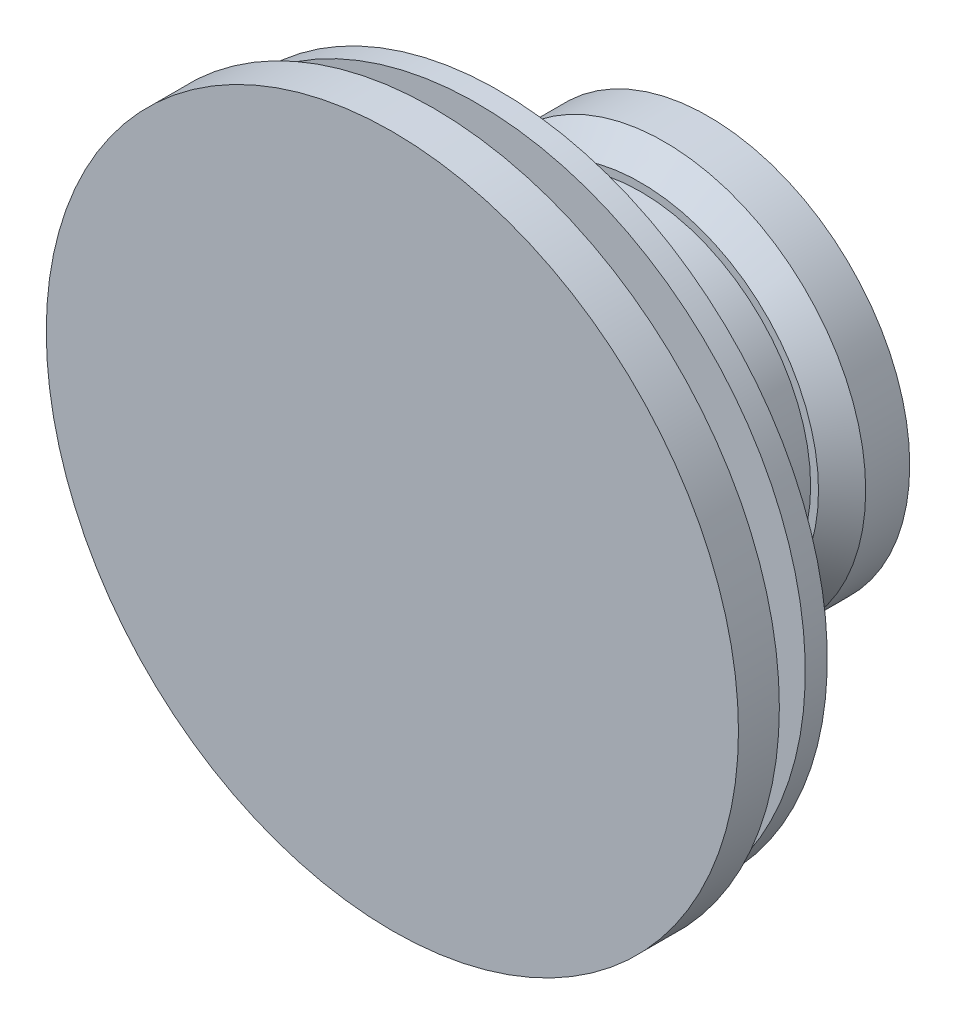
from build123d import *

# Parameters (mm, degrees)
CUT_EXTRUDE1_DEPTH = 0.254


with BuildPart() as part:
    # Sketch1 → Revolve1 (revolve)
    with BuildSketch(Plane(origin=(0, 0, 0), x_dir=(1, 0, 0), z_dir=(0, 1, 0)), mode=Mode.PRIVATE) as revolve1_sk:
        with BuildLine():
            Line((0, 0), (27.94, 0))
            Line((27.94, 0), (27.94, 3.302))
            Line((27.94, 3.302), (24.13, 3.302))
            Line((24.13, 3.302), (24.13, 4.302))
            Line((24.13, 4.302), (22.0472, 4.302))
            Line((22.0472, 4.302), (22.0472, 6.842))
            Line((22.0472, 6.842), (26.4922, 6.842))
            Line((26.4922, 6.842), (26.4922, 8.62))
            Line((26.4922, 8.62), (13.716, 8.62))
            Line((13.716, 8.62), (13.716, 20.05))
            Line((13.716, 20.05), (14.351, 20.05))
            Line((14.351, 20.05), (16.256, 21.955))
            Line((16.256, 21.955), (16.256, 25.511))
            Line((16.256, 25.511), (15.256000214, 25.511654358))
            Line((15.256000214, 25.511654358), (15.256000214, 25.003654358))
            Line((15.256000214, 25.003654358), (12.208000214, 23.243890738))
            ThreePointArc((12.208000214, 23.243890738), (6.136515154, 24.189362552), (0, 24.505637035))
            Line((0, 24.505637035), (0, 0))
        make_face()
    revolve(revolve1_sk.sketch.rotate(Axis((0, 0, 0), (0, 0, 1)), 180), axis=Axis((0, 0, 0), (0, 0, 1)))

    # Sketch2 → Cut-Extrude1 (cut)
    with BuildSketch(Plane(origin=(0, 0, -8.62), x_dir=(-1, 0, 0), z_dir=(0, 0, -1))):
        with BuildLine():
            Line((-6.435897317, -19.51201886), (-6.749999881, -19.51201886))
            add(Edge.make_bspline(
                [(-6.749999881, -19.51201886), (-6.747952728, -19.470347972), (-6.743932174, -19.388507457), (-6.725103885, -19.269183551), (-6.698163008, -19.155128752), (-6.660071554, -19.047258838), (-6.612765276, -18.944620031), (-6.556035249, -18.847620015), (-6.488841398, -18.756628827), (-6.412634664, -18.672489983), (-6.329866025, -18.595302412), (-6.240560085, -18.52864717), (-6.146715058, -18.472329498), (-6.048615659, -18.425248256), (-5.945155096, -18.389908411), (-5.837272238, -18.363686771), (-5.724493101, -18.347910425), (-5.647653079, -18.34621464), (-5.608573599, -18.345352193)],
                knots=[0, 0, 0, 0, 1.10065271, 2.161652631, 3.183658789, 4.190468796, 5.17591951, 6.163126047, 7.15150782, 8.156236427, 9.156009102, 10.134482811, 11.092018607, 12.041330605, 13.001268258, 13.972401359, 14.968799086, 16, 16, 16, 16], degree=3))
            add(Edge.make_bspline(
                [(-5.608573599, -18.345352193), (-5.570195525, -18.346250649), (-5.49478398, -18.348016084), (-5.384721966, -18.363177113), (-5.279944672, -18.386922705), (-5.180656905, -18.420238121), (-5.08765084, -18.465022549), (-5.000227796, -18.518820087), (-4.917346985, -18.581039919), (-4.842740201, -18.654293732), (-4.774232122, -18.732496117), (-4.715129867, -18.81598402), (-4.664516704, -18.902213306), (-4.622329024, -18.991841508), (-4.591272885, -19.085712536), (-4.567694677, -19.182459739), (-4.554367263, -19.28308455), (-4.55232184, -19.351191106), (-4.551281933, -19.385816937)],
                knots=[0, 0, 0, 0, 1.111607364, 2.184268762, 3.212621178, 4.221274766, 5.211760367, 6.196651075, 7.1921475, 8.207485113, 9.220403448, 10.201281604, 11.166441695, 12.114753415, 13.065576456, 14.026450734, 14.996634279, 16, 16, 16, 16], degree=3))
            add(Edge.make_bspline(
                [(-4.551281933, -19.385816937), (-4.552975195, -19.434564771), (-4.556332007, -19.531204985), (-4.585046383, -19.673219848), (-4.629892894, -19.810813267), (-4.683890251, -19.921550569), (-4.738362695, -20.010784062), (-4.787450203, -20.084252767), (-4.844915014, -20.163358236), (-4.911593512, -20.247835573), (-4.986106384, -20.338346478), (-5.069128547, -20.434836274), (-5.161252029, -20.536308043), (-5.22591053, -20.605613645), (-5.259414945, -20.641526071)],
                knots=[0, 0, 0, 0, 1.184426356, 2.348067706, 3.509069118, 4.696110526, 5.333549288, 6.050745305, 6.844228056, 7.710549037, 8.667450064, 9.695053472, 10.805634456, 12, 12, 12, 12], degree=3))
            Line((-5.259414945, -20.641526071), (-6.135116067, -21.576121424))
            Line((-6.135116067, -21.576121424), (-4.506410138, -21.576121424))
            Line((-4.506410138, -21.576121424), (-4.506410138, -21.935095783))
            Line((-4.506410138, -21.935095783), (-6.884615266, -21.935095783))
            Line((-6.884615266, -21.935095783), (-5.527243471, -20.486578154))
            add(Edge.make_bspline(
                [(-5.527243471, -20.486578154), (-5.494195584, -20.452079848), (-5.430717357, -20.385815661), (-5.34093478, -20.289072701), (-5.260295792, -20.19932316), (-5.188278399, -20.116736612), (-5.126444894, -20.040105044), (-5.071572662, -19.971910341), (-5.027607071, -19.90915589), (-4.979891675, -19.836415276), (-4.933677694, -19.747602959), (-4.893965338, -19.63906927), (-4.869750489, -19.527342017), (-4.866845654, -19.45183998), (-4.865384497, -19.413861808)],
                knots=[0, 0, 0, 0, 1.329631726, 2.553950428, 3.673215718, 4.687767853, 5.603093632, 6.413772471, 7.123043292, 7.734684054, 8.834405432, 9.900288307, 10.943827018, 12, 12, 12, 12], degree=3))
            add(Edge.make_bspline(
                [(-4.865384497, -19.413861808), (-4.866020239, -19.38998041), (-4.867273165, -19.34291476), (-4.878330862, -19.273909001), (-4.895041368, -19.207344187), (-4.918986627, -19.143015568), (-4.950593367, -19.081569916), (-4.989066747, -19.022932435), (-5.03345681, -18.96624347), (-5.084808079, -18.913090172), (-5.141219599, -18.864408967), (-5.200813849, -18.821284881), (-5.263863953, -18.78524577), (-5.330104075, -18.755702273), (-5.399349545, -18.732526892), (-5.47173429, -18.716468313), (-5.547058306, -18.706385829), (-5.598491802, -18.705021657), (-5.6246994, -18.704326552)],
                knots=[0, 0, 0, 0, 0.991446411, 1.95395049, 2.89581595, 3.838931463, 4.798493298, 5.75982156, 6.748411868, 7.785213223, 8.824556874, 9.840280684, 10.836137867, 11.835679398, 12.848801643, 13.863922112, 14.911575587, 16, 16, 16, 16], degree=3))
            add(Edge.make_bspline(
                [(-5.6246994, -18.704326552), (-5.652070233, -18.705041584), (-5.705822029, -18.706445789), (-5.784741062, -18.716268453), (-5.86002684, -18.733214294), (-5.931868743, -18.756390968), (-6.000388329, -18.785849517), (-6.065252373, -18.822541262), (-6.126315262, -18.866324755), (-6.183691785, -18.915965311), (-6.236555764, -18.971232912), (-6.28300264, -19.032842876), (-6.323586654, -19.099670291), (-6.358995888, -19.171534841), (-6.387751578, -19.249088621), (-6.409724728, -19.332056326), (-6.427111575, -19.420077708), (-6.432920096, -19.480862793), (-6.435897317, -19.51201886)],
                knots=[0, 0, 0, 0, 1.031018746, 2.02475058, 2.990194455, 3.934040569, 4.864654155, 5.795059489, 6.735614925, 7.690564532, 8.649604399, 9.611025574, 10.590972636, 11.591080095, 12.624614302, 13.701020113, 14.821632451, 16, 16, 16, 16], degree=3))
        make_face()
        with BuildLine():
            Line((-1.993589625, -18.435095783), (-1.993589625, -18.794070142))
            Line((-1.993589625, -18.794070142), (-3.184094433, -18.794070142))
            Line((-3.184094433, -18.794070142), (-3.372696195, -19.714643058))
            add(Edge.make_bspline(
                [(-3.372696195, -19.714643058), (-3.335640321, -19.704412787), (-3.263850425, -19.684593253), (-3.157890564, -19.662587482), (-3.057298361, -19.649322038), (-2.99202299, -19.647510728), (-2.96043658, -19.646634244)],
                knots=[0, 0, 0, 0, 1.100273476, 2.13160584, 3.095893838, 4, 4, 4, 4], degree=3))
            add(Edge.make_bspline(
                [(-2.96043658, -19.646634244), (-2.92135284, -19.64748018), (-2.844504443, -19.649143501), (-2.732065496, -19.66511535), (-2.624732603, -19.690255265), (-2.522730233, -19.725375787), (-2.425869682, -19.77028552), (-2.33504212, -19.82638546), (-2.248884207, -19.891918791), (-2.168941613, -19.967263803), (-2.096417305, -20.05018542), (-2.032651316, -20.139343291), (-1.978488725, -20.233870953), (-1.93492797, -20.334671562), (-1.900143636, -20.440630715), (-1.876991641, -20.552863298), (-1.861574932, -20.670311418), (-1.859852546, -20.750615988), (-1.85897424, -20.791566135)],
                knots=[0, 0, 0, 0, 1.052922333, 2.070308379, 3.05430497, 4.020497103, 4.973039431, 5.925935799, 6.892292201, 7.88610001, 8.88166317, 9.857072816, 10.836096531, 11.812156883, 12.81219415, 13.836441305, 14.89672472, 16, 16, 16, 16], degree=3))
            add(Edge.make_bspline(
                [(-1.85897424, -20.791566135), (-1.859639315, -20.820088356), (-1.860960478, -20.876747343), (-1.867679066, -20.960891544), (-1.880614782, -21.043254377), (-1.897982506, -21.123846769), (-1.920524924, -21.202516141), (-1.947813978, -21.279487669), (-1.981210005, -21.354282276), (-2.017841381, -21.427607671), (-2.059087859, -21.497806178), (-2.104866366, -21.563455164), (-2.153231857, -21.625539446), (-2.205273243, -21.683393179), (-2.261474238, -21.736636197), (-2.321154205, -21.785584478), (-2.383836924, -21.831065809), (-2.450492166, -21.871234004), (-2.519634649, -21.90819696), (-2.592262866, -21.938520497), (-2.666723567, -21.965631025), (-2.744088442, -21.987240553), (-2.824182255, -22.004173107), (-2.90713703, -22.015673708), (-2.9925177, -22.024050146), (-3.050392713, -22.024574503), (-3.079627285, -22.024839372)],
                knots=[0, 0, 0, 0, 1.056347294, 2.098418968, 3.122841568, 4.141288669, 5.149314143, 6.15115421, 7.162517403, 8.180376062, 9.185164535, 10.17417709, 11.141909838, 12.097768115, 13.052685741, 14.0056014, 14.954263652, 15.917497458, 16.885230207, 17.854509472, 18.828990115, 19.81800267, 20.826176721, 21.857883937, 22.917946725, 24, 24, 24, 24], degree=3))
            add(Edge.make_bspline(
                [(-3.079627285, -22.024839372), (-3.114501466, -22.024148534), (-3.183112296, -22.022789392), (-3.283632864, -22.008570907), (-3.380347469, -21.988206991), (-3.47247757, -21.957570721), (-3.560848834, -21.919183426), (-3.644271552, -21.870667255), (-3.724877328, -21.815688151), (-3.799389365, -21.750807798), (-3.868545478, -21.679892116), (-3.930451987, -21.602934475), (-3.985585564, -21.521205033), (-4.033063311, -21.434306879), (-4.073561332, -21.342468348), (-4.10537632, -21.245345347), (-4.131054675, -21.143445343), (-4.141918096, -21.073291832), (-4.147435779, -21.037659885)],
                knots=[0, 0, 0, 0, 1.0467383, 2.05933395, 3.04377827, 4.011590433, 4.970194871, 5.932262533, 6.905835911, 7.896367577, 8.894135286, 9.877477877, 10.858688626, 11.851381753, 12.8477658, 13.868841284, 14.917554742, 16, 16, 16, 16], degree=3))
            Line((-4.147435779, -21.037659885), (-3.833333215, -21.037659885))
            add(Edge.make_bspline(
                [(-3.833333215, -21.037659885), (-3.825604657, -21.071036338), (-3.810749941, -21.135187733), (-3.778144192, -21.225319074), (-3.738278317, -21.305638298), (-3.690873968, -21.377207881), (-3.634323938, -21.439616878), (-3.569794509, -21.49523394), (-3.497446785, -21.545409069), (-3.417053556, -21.587231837), (-3.332240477, -21.62290059), (-3.243473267, -21.646652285), (-3.15316892, -21.663353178), (-3.09209055, -21.665024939), (-3.061398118, -21.665865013)],
                knots=[0, 0, 0, 0, 1.136247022, 2.183929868, 3.172523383, 4.106158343, 5.02341133, 5.958108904, 6.928429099, 7.938127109, 8.96079061, 9.975095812, 10.982467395, 12, 12, 12, 12], degree=3))
            add(Edge.make_bspline(
                [(-3.061398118, -21.665865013), (-3.031439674, -21.665044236), (-2.972451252, -21.663428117), (-2.885639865, -21.650989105), (-2.801826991, -21.631831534), (-2.721839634, -21.603161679), (-2.644278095, -21.56831696), (-2.571104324, -21.523601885), (-2.500201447, -21.472141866), (-2.433773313, -21.413185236), (-2.372933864, -21.348215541), (-2.319177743, -21.278738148), (-2.27440083, -21.204621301), (-2.236666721, -21.127148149), (-2.208013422, -21.045469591), (-2.187572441, -20.959968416), (-2.175569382, -20.870433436), (-2.173918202, -20.809364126), (-2.173076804, -20.778244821)],
                knots=[0, 0, 0, 0, 1.027316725, 2.022795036, 3.002884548, 3.971462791, 4.93288096, 5.914575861, 6.907176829, 7.935150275, 8.956128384, 9.956726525, 10.942570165, 11.921478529, 12.907843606, 13.90538589, 14.932640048, 16, 16, 16, 16], degree=3))
            add(Edge.make_bspline(
                [(-2.173076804, -20.778244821), (-2.173735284, -20.75016907), (-2.175024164, -20.69521478), (-2.185554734, -20.614815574), (-2.203871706, -20.538742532), (-2.229295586, -20.466628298), (-2.261575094, -20.398404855), (-2.301021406, -20.334001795), (-2.348374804, -20.274267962), (-2.402466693, -20.219175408), (-2.461724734, -20.168330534), (-2.527168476, -20.124986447), (-2.597428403, -20.088522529), (-2.671658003, -20.057054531), (-2.751622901, -20.034453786), (-2.835739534, -20.0174859), (-2.924916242, -20.007670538), (-2.98588693, -20.006308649), (-3.017227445, -20.005608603)],
                knots=[0, 0, 0, 0, 1.045622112, 2.046656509, 3.013763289, 3.955457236, 4.890082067, 5.820317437, 6.762574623, 7.722996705, 8.69280354, 9.665887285, 10.63943826, 11.638615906, 12.663482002, 13.728887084, 14.832589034, 16, 16, 16, 16], degree=3))
            add(Edge.make_bspline(
                [(-3.017227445, -20.005608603), (-3.044356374, -20.006189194), (-3.100370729, -20.007387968), (-3.186293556, -20.016214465), (-3.276585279, -20.030453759), (-3.370899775, -20.050040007), (-3.469520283, -20.075671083), (-3.572238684, -20.106385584), (-3.67927095, -20.143107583), (-3.751388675, -20.170839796), (-3.78846142, -20.185095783)],
                knots=[0, 0, 0, 0, 0.817624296, 1.688186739, 2.600797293, 3.572016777, 4.590301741, 5.671205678, 6.80286297, 8, 8, 8, 8], degree=3))
            Line((-3.78846142, -20.185095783), (-3.429487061, -18.435095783))
            Line((-3.429487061, -18.435095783), (-1.993589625, -18.435095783))
        make_face()
        with BuildLine():
            Line((-1.275640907, -19.377403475), (-0.961538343, -19.377403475))
            Line((-0.961538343, -19.377403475), (-0.961538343, -19.821914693))
            add(Edge.make_bspline(
                [(-0.961538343, -19.821914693), (-0.933254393, -19.783027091), (-0.879059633, -19.708514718), (-0.790193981, -19.610324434), (-0.701417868, -19.526996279), (-0.637484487, -19.483253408), (-0.606770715, -19.462239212)],
                knots=[0, 0, 0, 0, 1.134379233, 2.173579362, 3.122582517, 4, 4, 4, 4], degree=3))
            add(Edge.make_bspline(
                [(-0.606770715, -19.462239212), (-0.564906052, -19.442233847), (-0.481908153, -19.402572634), (-0.350488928, -19.362339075), (-0.216014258, -19.337613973), (-0.125206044, -19.3342326), (-0.079527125, -19.33253168)],
                knots=[0, 0, 0, 0, 1.014936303, 2.012140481, 3.000054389, 4, 4, 4, 4], degree=3))
            add(Edge.make_bspline(
                [(-0.079527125, -19.33253168), (-0.048634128, -19.333576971), (0.012501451, -19.335645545), (0.103085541, -19.34910558), (0.190944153, -19.372371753), (0.275558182, -19.404779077), (0.355278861, -19.444025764), (0.428368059, -19.490075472), (0.493992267, -19.541772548), (0.552118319, -19.601451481), (0.604387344, -19.670788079), (0.652466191, -19.751652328), (0.696891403, -19.845859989), (0.721512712, -19.91422653), (0.734475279, -19.950219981)],
                knots=[0, 0, 0, 0, 1.009824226, 1.998387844, 2.986035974, 3.974953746, 4.955485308, 5.885931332, 6.793869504, 7.679848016, 8.601185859, 9.625726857, 10.749998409, 12, 12, 12, 12], degree=3))
            add(Edge.make_bspline(
                [(0.734475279, -19.950219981), (0.74818653, -19.925495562), (0.775168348, -19.876841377), (0.820473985, -19.807983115), (0.867941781, -19.743576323), (0.917976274, -19.683569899), (0.970400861, -19.628260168), (1.025462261, -19.577464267), (1.082847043, -19.530964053), (1.162639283, -19.476640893), (1.26645189, -19.418939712), (1.397340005, -19.368911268), (1.533490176, -19.33799514), (1.625907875, -19.334364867), (1.672576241, -19.33253168)],
                knots=[0, 0, 0, 0, 0.86119277, 1.694706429, 2.50939023, 3.298075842, 4.073795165, 4.829715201, 5.57930267, 6.321991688, 7.768977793, 9.186738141, 10.579381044, 12, 12, 12, 12], degree=3))
            add(Edge.make_bspline(
                [(1.672576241, -19.33253168), (1.715457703, -19.334148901), (1.79938089, -19.337313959), (1.921558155, -19.362167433), (2.035499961, -19.40484508), (2.140977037, -19.463078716), (2.23613685, -19.5362579), (2.318853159, -19.623326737), (2.388623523, -19.72366936), (2.434202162, -19.818061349), (2.465117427, -19.901396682), (2.484178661, -19.972402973), (2.501018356, -20.050554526), (2.514999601, -20.135944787), (2.525218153, -20.228875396), (2.532788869, -20.329194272), (2.537912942, -20.436979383), (2.538275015, -20.511344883), (2.538461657, -20.549679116)],
                knots=[0, 0, 0, 0, 1.209669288, 2.367440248, 3.500751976, 4.631527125, 5.755587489, 6.87532382, 8.007944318, 9.190864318, 9.82315674, 10.514484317, 11.263564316, 12.079023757, 12.955305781, 13.901327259, 14.918167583, 16, 16, 16, 16], degree=3))
            Line((2.538461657, -20.549679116), (2.538461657, -21.935095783))
            Line((2.538461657, -21.935095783), (2.224359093, -21.935095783))
            Line((2.224359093, -21.935095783), (2.224359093, -20.548276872))
            add(Edge.make_bspline(
                [(2.224359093, -20.548276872), (2.22428121, -20.515556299), (2.224131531, -20.452672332), (2.221437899, -20.36241988), (2.216362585, -20.280151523), (2.210427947, -20.205979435), (2.202184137, -20.139730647), (2.191538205, -20.081538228), (2.180260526, -20.030944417), (2.161524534, -19.974858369), (2.131576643, -19.912988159), (2.085959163, -19.846264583), (2.028489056, -19.788183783), (1.9621289, -19.737765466), (1.886580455, -19.696771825), (1.803315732, -19.667495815), (1.71285168, -19.649372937), (1.650228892, -19.647566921), (1.617888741, -19.646634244)],
                knots=[0, 0, 0, 0, 1.253487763, 2.409012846, 3.458416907, 4.410876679, 5.259312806, 6.014470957, 6.676830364, 7.243083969, 8.276244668, 9.299465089, 10.325150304, 11.392391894, 12.482080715, 13.603491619, 14.762376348, 16, 16, 16, 16], degree=3))
            add(Edge.make_bspline(
                [(1.617888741, -19.646634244), (1.578218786, -19.648050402), (1.499815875, -19.650849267), (1.385370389, -19.67942314), (1.275399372, -19.722503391), (1.173184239, -19.784935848), (1.079156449, -19.859744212), (0.998256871, -19.948693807), (0.931424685, -20.049323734), (0.886170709, -20.142470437), (0.857581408, -20.22613988), (0.838704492, -20.299237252), (0.824021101, -20.38231882), (0.810250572, -20.474826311), (0.801262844, -20.577396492), (0.793094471, -20.689554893), (0.789273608, -20.811638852), (0.78873915, -20.896265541), (0.788461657, -20.940203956)],
                knots=[0, 0, 0, 0, 1.090531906, 2.155305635, 3.229839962, 4.33261226, 5.44038871, 6.529323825, 7.629011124, 8.757537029, 9.370236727, 10.061839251, 10.834451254, 11.692844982, 12.636905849, 13.66920014, 14.789842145, 16, 16, 16, 16], degree=3))
            Line((0.788461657, -20.940203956), (0.788461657, -21.935095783))
            Line((0.788461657, -21.935095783), (0.474359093, -21.935095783))
            Line((0.474359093, -21.935095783), (0.474359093, -20.634514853))
            add(Edge.make_bspline(
                [(0.474359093, -20.634514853), (0.474279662, -20.597821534), (0.474126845, -20.527227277), (0.471450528, -20.425993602), (0.466363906, -20.333912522), (0.460483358, -20.251091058), (0.452023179, -20.177679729), (0.442413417, -20.113284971), (0.431064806, -20.05806822), (0.412274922, -19.997504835), (0.383560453, -19.930783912), (0.337372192, -19.859642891), (0.279764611, -19.797374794), (0.212193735, -19.744216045), (0.136188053, -19.700274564), (0.052204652, -19.668614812), (-0.039000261, -19.650190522), (-0.101877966, -19.647842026), (-0.134214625, -19.646634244)],
                knots=[0, 0, 0, 0, 1.320475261, 2.540461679, 3.643808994, 4.639130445, 5.527981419, 6.302341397, 6.981980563, 7.553956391, 8.582137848, 9.585246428, 10.591171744, 11.620968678, 12.668337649, 13.738356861, 14.836885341, 16, 16, 16, 16], degree=3))
            add(Edge.make_bspline(
                [(-0.134214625, -19.646634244), (-0.172230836, -19.648164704), (-0.247995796, -19.651214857), (-0.359297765, -19.678669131), (-0.466783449, -19.721673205), (-0.568738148, -19.781333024), (-0.662412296, -19.855232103), (-0.744420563, -19.942146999), (-0.813363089, -20.040996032), (-0.859094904, -20.133160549), (-0.888593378, -20.214733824), (-0.908188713, -20.284084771), (-0.925028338, -20.36108502), (-0.93754236, -20.445972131), (-0.949622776, -20.538193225), (-0.955453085, -20.638207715), (-0.961124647, -20.745929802), (-0.961397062, -20.820302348), (-0.961538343, -20.858873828)],
                knots=[0, 0, 0, 0, 1.098833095, 2.189935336, 3.297829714, 4.440610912, 5.596351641, 6.740013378, 7.886572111, 9.072425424, 9.705826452, 10.395263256, 11.156850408, 11.985370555, 12.878090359, 13.847760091, 14.883794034, 16, 16, 16, 16], degree=3))
            Line((-0.961538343, -20.858873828), (-0.961538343, -21.935095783))
            Line((-0.961538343, -21.935095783), (-1.275640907, -21.935095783))
            Line((-1.275640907, -21.935095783), (-1.275640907, -19.377403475))
        make_face()
        with BuildLine():
            Line((3.256410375, -19.377403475), (3.570512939, -19.377403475))
            Line((3.570512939, -19.377403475), (3.570512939, -19.821914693))
            add(Edge.make_bspline(
                [(3.570512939, -19.821914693), (3.598796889, -19.783027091), (3.652991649, -19.708514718), (3.741857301, -19.610324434), (3.830633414, -19.526996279), (3.894566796, -19.483253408), (3.925280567, -19.462239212)],
                knots=[0, 0, 0, 0, 1.134379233, 2.173579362, 3.122582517, 4, 4, 4, 4], degree=3))
            add(Edge.make_bspline(
                [(3.925280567, -19.462239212), (3.96714523, -19.442233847), (4.050143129, -19.402572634), (4.181562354, -19.362339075), (4.316037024, -19.337613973), (4.406845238, -19.3342326), (4.452524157, -19.33253168)],
                knots=[0, 0, 0, 0, 1.014936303, 2.012140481, 3.000054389, 4, 4, 4, 4], degree=3))
            add(Edge.make_bspline(
                [(4.452524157, -19.33253168), (4.483417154, -19.333576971), (4.544552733, -19.335645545), (4.635136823, -19.34910558), (4.722995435, -19.372371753), (4.807609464, -19.404779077), (4.887330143, -19.444025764), (4.960419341, -19.490075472), (5.026043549, -19.541772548), (5.084169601, -19.601451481), (5.136438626, -19.670788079), (5.184517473, -19.751652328), (5.228942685, -19.845859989), (5.253563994, -19.91422653), (5.266526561, -19.950219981)],
                knots=[0, 0, 0, 0, 1.009824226, 1.998387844, 2.986035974, 3.974953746, 4.955485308, 5.885931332, 6.793869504, 7.679848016, 8.601185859, 9.625726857, 10.749998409, 12, 12, 12, 12], degree=3))
            add(Edge.make_bspline(
                [(5.266526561, -19.950219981), (5.280237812, -19.925495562), (5.30721963, -19.876841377), (5.352525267, -19.807983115), (5.399993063, -19.743576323), (5.450027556, -19.683569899), (5.502452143, -19.628260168), (5.557513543, -19.577464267), (5.614898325, -19.530964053), (5.694690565, -19.476640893), (5.798503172, -19.418939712), (5.929391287, -19.368911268), (6.065541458, -19.33799514), (6.157959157, -19.334364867), (6.204627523, -19.33253168)],
                knots=[0, 0, 0, 0, 0.86119277, 1.694706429, 2.50939023, 3.298075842, 4.073795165, 4.829715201, 5.57930267, 6.321991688, 7.768977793, 9.186738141, 10.579381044, 12, 12, 12, 12], degree=3))
            add(Edge.make_bspline(
                [(6.204627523, -19.33253168), (6.247508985, -19.334148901), (6.331432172, -19.337313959), (6.453609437, -19.362167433), (6.567551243, -19.40484508), (6.673028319, -19.463078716), (6.768188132, -19.5362579), (6.850904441, -19.623326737), (6.920674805, -19.72366936), (6.966253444, -19.818061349), (6.997168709, -19.901396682), (7.016229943, -19.972402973), (7.033069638, -20.050554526), (7.047050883, -20.135944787), (7.057269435, -20.228875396), (7.064840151, -20.329194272), (7.069964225, -20.436979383), (7.070326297, -20.511344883), (7.070512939, -20.549679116)],
                knots=[0, 0, 0, 0, 1.209669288, 2.367440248, 3.500751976, 4.631527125, 5.755587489, 6.87532382, 8.007944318, 9.190864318, 9.82315674, 10.514484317, 11.263564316, 12.079023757, 12.955305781, 13.901327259, 14.918167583, 16, 16, 16, 16], degree=3))
            Line((7.070512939, -20.549679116), (7.070512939, -21.935095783))
            Line((7.070512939, -21.935095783), (6.756410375, -21.935095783))
            Line((6.756410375, -21.935095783), (6.756410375, -20.548276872))
            add(Edge.make_bspline(
                [(6.756410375, -20.548276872), (6.756332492, -20.515556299), (6.756182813, -20.452672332), (6.753489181, -20.36241988), (6.748413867, -20.280151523), (6.742479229, -20.205979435), (6.734235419, -20.139730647), (6.723589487, -20.081538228), (6.712311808, -20.030944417), (6.693575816, -19.974858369), (6.663627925, -19.912988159), (6.618010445, -19.846264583), (6.560540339, -19.788183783), (6.494180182, -19.737765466), (6.418631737, -19.696771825), (6.335367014, -19.667495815), (6.244902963, -19.649372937), (6.182280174, -19.647566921), (6.149940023, -19.646634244)],
                knots=[0, 0, 0, 0, 1.253487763, 2.409012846, 3.458416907, 4.410876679, 5.259312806, 6.014470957, 6.676830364, 7.243083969, 8.276244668, 9.299465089, 10.325150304, 11.392391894, 12.482080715, 13.603491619, 14.762376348, 16, 16, 16, 16], degree=3))
            add(Edge.make_bspline(
                [(6.149940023, -19.646634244), (6.110270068, -19.648050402), (6.031867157, -19.650849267), (5.917421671, -19.67942314), (5.807450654, -19.722503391), (5.705235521, -19.784935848), (5.611207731, -19.859744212), (5.530308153, -19.948693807), (5.463475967, -20.049323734), (5.418221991, -20.142470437), (5.38963269, -20.22613988), (5.370755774, -20.299237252), (5.356072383, -20.38231882), (5.342301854, -20.474826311), (5.333314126, -20.577396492), (5.325145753, -20.689554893), (5.321324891, -20.811638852), (5.320790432, -20.896265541), (5.320512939, -20.940203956)],
                knots=[0, 0, 0, 0, 1.090531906, 2.155305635, 3.229839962, 4.33261226, 5.44038871, 6.529323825, 7.629011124, 8.757537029, 9.370236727, 10.061839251, 10.834451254, 11.692844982, 12.636905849, 13.66920014, 14.789842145, 16, 16, 16, 16], degree=3))
            Line((5.320512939, -20.940203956), (5.320512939, -21.935095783))
            Line((5.320512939, -21.935095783), (5.006410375, -21.935095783))
            Line((5.006410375, -21.935095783), (5.006410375, -20.634514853))
            add(Edge.make_bspline(
                [(5.006410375, -20.634514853), (5.006330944, -20.597821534), (5.006178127, -20.527227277), (5.00350181, -20.425993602), (4.998415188, -20.333912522), (4.99253464, -20.251091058), (4.984074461, -20.177679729), (4.974464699, -20.113284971), (4.963116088, -20.05806822), (4.944326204, -19.997504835), (4.915611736, -19.930783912), (4.869423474, -19.859642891), (4.811815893, -19.797374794), (4.744245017, -19.744216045), (4.668239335, -19.700274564), (4.584255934, -19.668614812), (4.493051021, -19.650190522), (4.430173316, -19.647842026), (4.397836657, -19.646634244)],
                knots=[0, 0, 0, 0, 1.320475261, 2.540461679, 3.643808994, 4.639130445, 5.527981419, 6.302341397, 6.981980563, 7.553956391, 8.582137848, 9.585246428, 10.591171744, 11.620968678, 12.668337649, 13.738356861, 14.836885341, 16, 16, 16, 16], degree=3))
            add(Edge.make_bspline(
                [(4.397836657, -19.646634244), (4.359820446, -19.648164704), (4.284055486, -19.651214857), (4.172753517, -19.678669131), (4.065267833, -19.721673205), (3.963313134, -19.781333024), (3.869638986, -19.855232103), (3.787630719, -19.942146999), (3.718688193, -20.040996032), (3.672956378, -20.133160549), (3.643457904, -20.214733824), (3.623862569, -20.284084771), (3.607022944, -20.36108502), (3.594508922, -20.445972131), (3.582428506, -20.538193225), (3.576598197, -20.638207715), (3.570926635, -20.745929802), (3.57065422, -20.820302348), (3.570512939, -20.858873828)],
                knots=[0, 0, 0, 0, 1.098833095, 2.189935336, 3.297829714, 4.440610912, 5.596351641, 6.740013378, 7.886572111, 9.072425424, 9.705826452, 10.395263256, 11.156850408, 11.985370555, 12.878090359, 13.847760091, 14.883794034, 16, 16, 16, 16], degree=3))
            Line((3.570512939, -20.858873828), (3.570512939, -21.935095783))
            Line((3.570512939, -21.935095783), (3.256410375, -21.935095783))
            Line((3.256410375, -21.935095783), (3.256410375, -19.377403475))
        make_face()
    extrude(amount=-CUT_EXTRUDE1_DEPTH, mode=Mode.SUBTRACT)


solid = part.part
